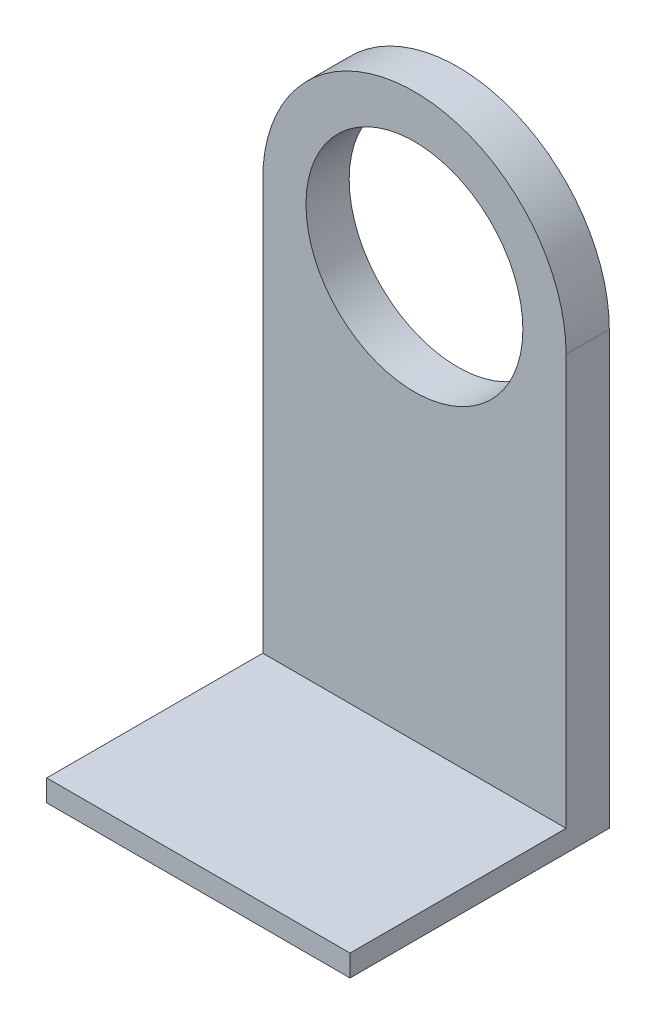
from build123d import *

# Parameters (mm, degrees)
SKETCH1_R      = 31.875
EXTRUDE1_DEPTH = 12.7
SKETCH2_W      = 89.15
SKETCH2_H      = 6.35
EXTRUDE2_DEPTH = 63.5


with BuildPart() as part:
    # Sketch1 → Extrude1 (new body)
    with BuildSketch(Plane.XY):
        with BuildLine():
            Line((44.575, 0), (44.575, -127))
            Line((44.575, -127), (-44.575, -127))
            Line((-44.575, -127), (-44.575, 0))
            ThreePointArc((-44.575, 0), (0, 44.575), (44.575, 0))
        make_face()
        Circle(SKETCH1_R, mode=Mode.SUBTRACT)
    extrude(amount=EXTRUDE1_DEPTH)

    # Sketch2 → Extrude2 (add)
    with BuildSketch(Plane.XY.offset(12.7)):
        with Locations((0, -123.825)):
            Rectangle(SKETCH2_W, SKETCH2_H)
    extrude(amount=EXTRUDE2_DEPTH)


solid = part.part
